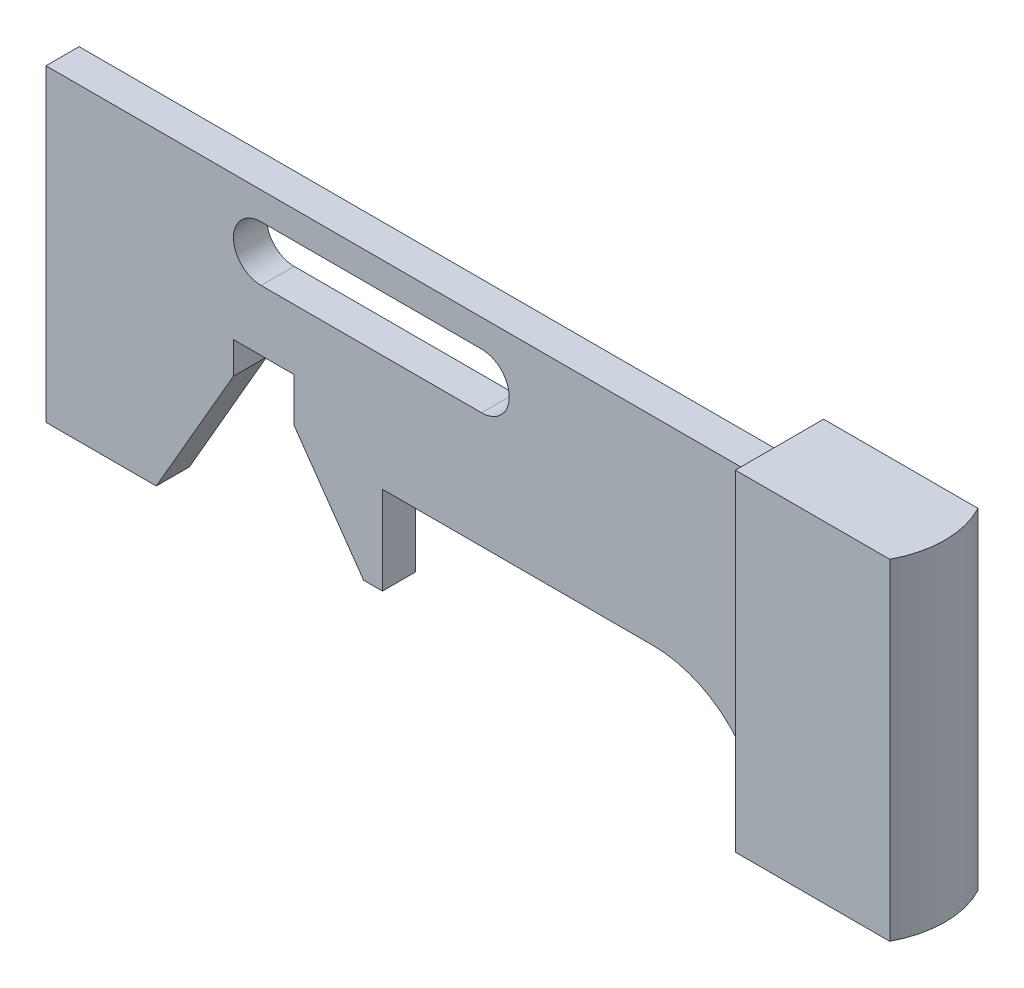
from build123d import *

# Parameters (mm, degrees)
LINEAR_AUSTRAGEN1_DEPTH        = 30
LANGLOCH_DEPTH                 = 1.5
SKIZZE4_W                      = 65
SKIZZE4_H                      = 2
AUSSPARUNG_F_R_SCHL_SSEL_DEPTH = 1.5


with BuildPart() as part:
    # Skizze2 → Linear austragen1 (new body)
    with BuildSketch(Plane(origin=(0, 0, 0), x_dir=(1, 0, 0), z_dir=(0, 1, 0))):
        with BuildLine():
            Line((0, -1.5), (65, -1.5))
            Line((65, -1.5), (65, -4))
            Line((65, -4), (79, -4))
            ThreePointArc((79, -4), (80, 0), (79, 4))
            Line((79, 4), (65, 4))
            Line((65, 4), (65, 1.5))
            Line((65, 1.5), (0, 1.5))
            Line((0, 1.5), (0, -1.5))
        make_face()
    extrude(amount=LINEAR_AUSTRAGEN1_DEPTH)

    # Skizze3 → Langloch (cut, symmetric)
    with BuildSketch(Plane.XY):
        with BuildLine():
            Line((19.5, 25.5), (39.5, 25.5))
            ThreePointArc((39.5, 25.5), (42, 23), (39.5, 20.5))
            Line((39.5, 20.5), (19.5, 20.5))
            ThreePointArc((19.5, 20.5), (17, 23), (19.5, 25.5))
        make_face()
    extrude(amount=LANGLOCH_DEPTH, both=True, mode=Mode.SUBTRACT)

    # Skizze4 → Aussparung f_r Schl_ssel (cut, symmetric)
    with BuildSketch(Plane.XY):
        with Locations((32.5, 29)):
            Rectangle(SKIZZE4_W, SKIZZE4_H)
        with BuildLine():
            Line((10, 0), (17, 12.124355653))
            Line((17, 12.124355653), (17, 15))
            Line((17, 15), (22.5, 15))
            Line((22.5, 15), (22.5, 10.997332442))
            Line((22.5, 10.997332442), (28.8, 2))
            Line((28.8, 2), (30.5, 2))
            Line((30.5, 2), (30.5, 10))
            Line((30.5, 10), (55, 10))
            ThreePointArc((55, 10), (62.071067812, 7.071067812), (65, 0))
            Line((65, 0), (10, 0))
        make_face()
    extrude(amount=AUSSPARUNG_F_R_SCHL_SSEL_DEPTH, both=True, mode=Mode.SUBTRACT)


solid = part.part
